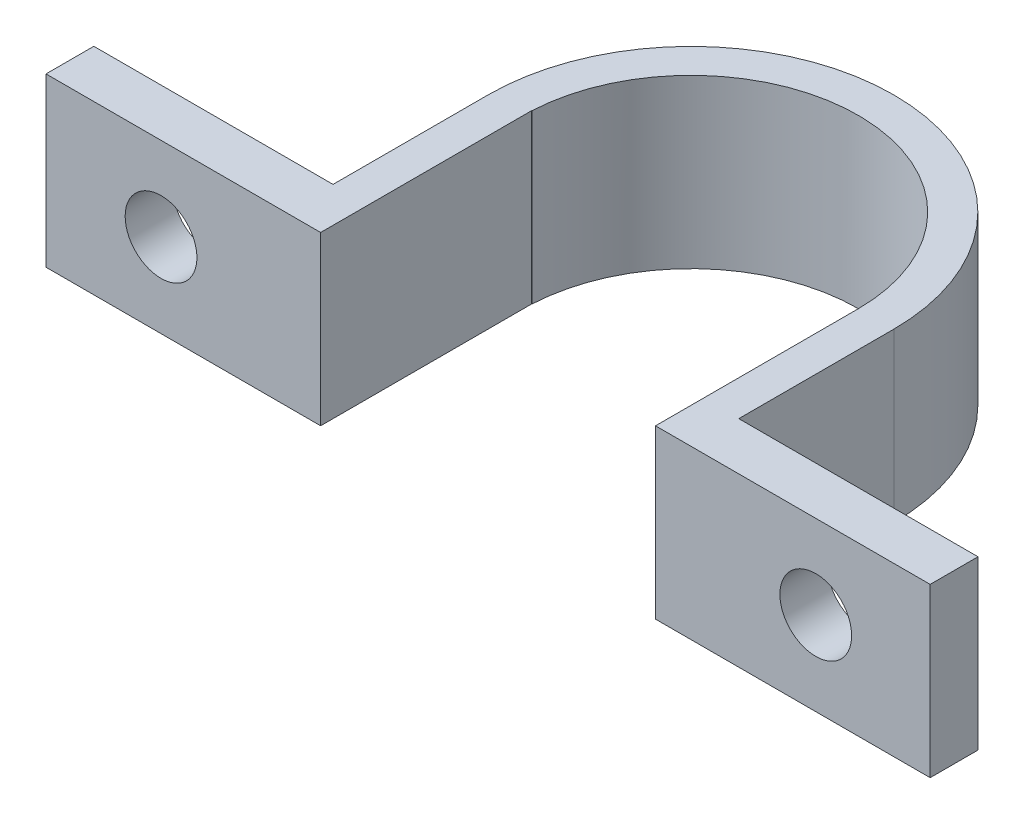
ISO-10303-21;
HEADER;
FILE_DESCRIPTION(('STEP AP214'),'2;1');
FILE_NAME('part.step','',(''),(''),'','','');
FILE_SCHEMA(('AUTOMOTIVE_DESIGN { 1 0 10303 214 1 1 1 1 }'));
ENDSEC;
DATA;
#1=APPLICATION_CONTEXT('core data for automotive mechanical design processes');
#2=APPLICATION_PROTOCOL_DEFINITION('international standard','automotive_design',2000,#1);
#3=PRODUCT_CONTEXT('',#1,'mechanical');
#4=PRODUCT('Part','Part','',(#3));
#5=PRODUCT_RELATED_PRODUCT_CATEGORY('part','',(#4));
#6=PRODUCT_DEFINITION_FORMATION('','',#4);
#7=PRODUCT_DEFINITION_CONTEXT('part definition',#1,'design');
#8=PRODUCT_DEFINITION('design','',#6,#7);
#9=PRODUCT_DEFINITION_SHAPE('','',#8);
#10=(LENGTH_UNIT() NAMED_UNIT(*) SI_UNIT(.MILLI.,.METRE.));
#11=(NAMED_UNIT(*) PLANE_ANGLE_UNIT() SI_UNIT($,.RADIAN.));
#12=(NAMED_UNIT(*) SI_UNIT($,.STERADIAN.) SOLID_ANGLE_UNIT());
#13=UNCERTAINTY_MEASURE_WITH_UNIT(LENGTH_MEASURE(1.E-05),#10,'distance_accuracy_value','');
#14=(GEOMETRIC_REPRESENTATION_CONTEXT(3) GLOBAL_UNCERTAINTY_ASSIGNED_CONTEXT((#13)) GLOBAL_UNIT_ASSIGNED_CONTEXT((#10,
#11,#12)) REPRESENTATION_CONTEXT('',''));
#15=CARTESIAN_POINT('',(0.,0.,0.));
#16=DIRECTION('',(0.,0.,1.));
#17=DIRECTION('',(1.,0.,0.));
#18=AXIS2_PLACEMENT_3D('',#15,#16,#17);
#19=CARTESIAN_POINT('',(0.,4.,0.));
#20=DIRECTION('',(0.,1.,0.));
#21=DIRECTION('',(0.,0.,1.));
#22=AXIS2_PLACEMENT_3D('',#19,#20,#21);
#23=CYLINDRICAL_SURFACE('',#22,7.);
#24=DIRECTION('',(0.,1.,0.));
#25=VECTOR('',#24,1.);
#26=CARTESIAN_POINT('',(-6.99172907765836,-9.00000000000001,-0.34018304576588));
#27=LINE('',#26,#25);
#28=CARTESIAN_POINT('',(-6.99172907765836,7.,-0.34018304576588));
#29=VERTEX_POINT('',#28);
#30=CARTESIAN_POINT('',(-6.99172907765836,0.,-0.34018304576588));
#31=VERTEX_POINT('',#30);
#32=EDGE_CURVE('E299',#29,#31,#27,.F.);
#33=ORIENTED_EDGE('',*,*,#32,.T.);
#34=CARTESIAN_POINT('',(0.,0.,0.));
#35=DIRECTION('',(0.,1.,0.));
#36=DIRECTION('',(0.,0.,1.));
#37=AXIS2_PLACEMENT_3D('',#34,#35,#36);
#38=CIRCLE('',#37,7.);
#39=CARTESIAN_POINT('',(6.99172907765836,0.,0.340183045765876));
#40=VERTEX_POINT('',#39);
#41=EDGE_CURVE('E191',#40,#31,#38,.T.);
#42=ORIENTED_EDGE('',*,*,#41,.F.);
#43=DIRECTION('',(0.,1.,0.));
#44=VECTOR('',#43,1.);
#45=CARTESIAN_POINT('',(6.99172907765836,-9.00000000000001,0.340183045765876));
#46=LINE('',#45,#44);
#47=CARTESIAN_POINT('',(6.99172907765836,4.,0.340183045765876));
#48=VERTEX_POINT('',#47);
#49=EDGE_CURVE('E189',#48,#40,#46,.F.);
#50=ORIENTED_EDGE('',*,*,#49,.F.);
#51=CARTESIAN_POINT('',(0.,4.,0.));
#52=DIRECTION('',(0.,1.,0.));
#53=DIRECTION('',(0.,0.,1.));
#54=AXIS2_PLACEMENT_3D('',#51,#52,#53);
#55=CIRCLE('',#54,7.);
#56=CARTESIAN_POINT('',(7.,4.,0.));
#57=VERTEX_POINT('',#56);
#58=EDGE_CURVE('E195',#48,#57,#55,.T.);
#59=ORIENTED_EDGE('',*,*,#58,.T.);
#60=DIRECTION('',(0.,1.,0.));
#61=VECTOR('',#60,1.);
#62=CARTESIAN_POINT('',(7.,4.,0.));
#63=LINE('',#62,#61);
#64=CARTESIAN_POINT('',(7.,7.,0.));
#65=VERTEX_POINT('',#64);
#66=EDGE_CURVE('E204',#57,#65,#63,.T.);
#67=ORIENTED_EDGE('',*,*,#66,.T.);
#68=CARTESIAN_POINT('',(0.,7.,0.));
#69=DIRECTION('',(0.,1.,0.));
#70=DIRECTION('',(0.,0.,1.));
#71=AXIS2_PLACEMENT_3D('',#68,#69,#70);
#72=CIRCLE('',#71,7.);
#73=EDGE_CURVE('E211',#65,#29,#72,.T.);
#74=ORIENTED_EDGE('',*,*,#73,.T.);
#75=EDGE_LOOP('',(#33,#42,#50,#59,#67,#74));
#76=FACE_BOUND('',#75,.T.);
#77=ADVANCED_FACE('F58',(#76),#23,.F.);
#78=CARTESIAN_POINT('',(0.,7.,0.));
#79=DIRECTION('',(0.,1.,0.));
#80=DIRECTION('',(0.,0.,1.));
#81=AXIS2_PLACEMENT_3D('',#78,#79,#80);
#82=PLANE('',#81);
#83=DIRECTION('',(-1.,0.,0.));
#84=VECTOR('',#83,1.);
#85=CARTESIAN_POINT('',(-7.,7.,8.48148798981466));
#86=LINE('',#85,#84);
#87=CARTESIAN_POINT('',(-7.,7.,8.48148798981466));
#88=VERTEX_POINT('',#87);
#89=CARTESIAN_POINT('',(-18.4814879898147,7.,8.48148798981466));
#90=VERTEX_POINT('',#89);
#91=EDGE_CURVE('E259',#88,#90,#86,.T.);
#92=ORIENTED_EDGE('',*,*,#91,.F.);
#93=DIRECTION('',(0.,0.,1.));
#94=VECTOR('',#93,1.);
#95=CARTESIAN_POINT('',(-7.,7.,0.));
#96=LINE('',#95,#94);
#97=CARTESIAN_POINT('',(-7.,7.,-0.34018304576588));
#98=VERTEX_POINT('',#97);
#99=EDGE_CURVE('E201',#98,#88,#96,.T.);
#100=ORIENTED_EDGE('',*,*,#99,.F.);
#101=DIRECTION('',(1.,0.,0.));
#102=VECTOR('',#101,1.);
#103=CARTESIAN_POINT('',(-7.,7.,-0.34018304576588));
#104=LINE('',#103,#102);
#105=EDGE_CURVE('E280',#98,#29,#104,.T.);
#106=ORIENTED_EDGE('',*,*,#105,.T.);
#107=ORIENTED_EDGE('',*,*,#73,.F.);
#108=DIRECTION('',(0.,0.,-1.));
#109=VECTOR('',#108,1.);
#110=CARTESIAN_POINT('',(7.,7.,10.4814879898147));
#111=LINE('',#110,#109);
#112=CARTESIAN_POINT('',(7.,7.,8.48148798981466));
#113=VERTEX_POINT('',#112);
#114=EDGE_CURVE('E205',#113,#65,#111,.T.);
#115=ORIENTED_EDGE('',*,*,#114,.F.);
#116=DIRECTION('',(-1.,0.,0.));
#117=VECTOR('',#116,1.);
#118=CARTESIAN_POINT('',(7.,7.,8.48148798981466));
#119=LINE('',#118,#117);
#120=CARTESIAN_POINT('',(18.4814879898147,7.,8.48148798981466));
#121=VERTEX_POINT('',#120);
#122=EDGE_CURVE('E75',#121,#113,#119,.T.);
#123=ORIENTED_EDGE('',*,*,#122,.F.);
#124=DIRECTION('',(0.,0.,1.));
#125=VECTOR('',#124,1.);
#126=CARTESIAN_POINT('',(18.4814879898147,7.,0.));
#127=LINE('',#126,#125);
#128=CARTESIAN_POINT('',(18.4814879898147,7.,6.48148798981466));
#129=VERTEX_POINT('',#128);
#130=EDGE_CURVE('E225',#129,#121,#127,.T.);
#131=ORIENTED_EDGE('',*,*,#130,.F.);
#132=DIRECTION('',(-1.,0.,0.));
#133=VECTOR('',#132,1.);
#134=CARTESIAN_POINT('',(8.48148798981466,7.,6.48148798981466));
#135=LINE('',#134,#133);
#136=CARTESIAN_POINT('',(8.48148798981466,7.,6.48148798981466));
#137=VERTEX_POINT('',#136);
#138=EDGE_CURVE('E276',#129,#137,#135,.T.);
#139=ORIENTED_EDGE('',*,*,#138,.T.);
#140=DIRECTION('',(0.,0.,1.));
#141=VECTOR('',#140,1.);
#142=CARTESIAN_POINT('',(8.48148798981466,7.,0.));
#143=LINE('',#142,#141);
#144=CARTESIAN_POINT('',(8.48148798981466,7.,0.));
#145=VERTEX_POINT('',#144);
#146=EDGE_CURVE('E228',#145,#137,#143,.T.);
#147=ORIENTED_EDGE('',*,*,#146,.F.);
#148=CARTESIAN_POINT('',(0.,7.,0.));
#149=DIRECTION('',(0.,1.,0.));
#150=DIRECTION('',(0.,0.,1.));
#151=AXIS2_PLACEMENT_3D('',#148,#149,#150);
#152=CIRCLE('',#151,8.48148798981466);
#153=CARTESIAN_POINT('',(-8.48148798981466,7.,0.));
#154=VERTEX_POINT('',#153);
#155=EDGE_CURVE('E215',#154,#145,#152,.F.);
#156=ORIENTED_EDGE('',*,*,#155,.F.);
#157=DIRECTION('',(0.,0.,1.));
#158=VECTOR('',#157,1.);
#159=CARTESIAN_POINT('',(-8.48148798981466,7.,0.));
#160=LINE('',#159,#158);
#161=CARTESIAN_POINT('',(-8.48148798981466,7.,6.48148798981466));
#162=VERTEX_POINT('',#161);
#163=EDGE_CURVE('E218',#154,#162,#160,.T.);
#164=ORIENTED_EDGE('',*,*,#163,.T.);
#165=DIRECTION('',(-1.,0.,0.));
#166=VECTOR('',#165,1.);
#167=CARTESIAN_POINT('',(-18.4814879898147,7.,6.48148798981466));
#168=LINE('',#167,#166);
#169=CARTESIAN_POINT('',(-18.4814879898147,7.,6.48148798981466));
#170=VERTEX_POINT('',#169);
#171=EDGE_CURVE('E273',#162,#170,#168,.T.);
#172=ORIENTED_EDGE('',*,*,#171,.T.);
#173=DIRECTION('',(0.,0.,1.));
#174=VECTOR('',#173,1.);
#175=CARTESIAN_POINT('',(-18.4814879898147,7.,0.));
#176=LINE('',#175,#174);
#177=EDGE_CURVE('E222',#170,#90,#176,.T.);
#178=ORIENTED_EDGE('',*,*,#177,.T.);
#179=EDGE_LOOP('',(#92,#100,#106,#107,#115,#123,#131,#139,#147,#156,#164,#172,#178));
#180=FACE_BOUND('',#179,.T.);
#181=ADVANCED_FACE('F312',(#180),#82,.T.);
#182=CARTESIAN_POINT('',(0.,0.,0.));
#183=DIRECTION('',(0.,1.,0.));
#184=DIRECTION('',(0.,0.,1.));
#185=AXIS2_PLACEMENT_3D('',#182,#183,#184);
#186=PLANE('',#185);
#187=DIRECTION('',(-1.,0.,0.));
#188=VECTOR('',#187,1.);
#189=CARTESIAN_POINT('',(0.,0.,8.48148798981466));
#190=LINE('',#189,#188);
#191=CARTESIAN_POINT('',(18.4814879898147,0.,8.48148798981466));
#192=VERTEX_POINT('',#191);
#193=CARTESIAN_POINT('',(6.99172907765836,0.,8.48148798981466));
#194=VERTEX_POINT('',#193);
#195=EDGE_CURVE('E166',#192,#194,#190,.T.);
#196=ORIENTED_EDGE('',*,*,#195,.T.);
#197=DIRECTION('',(0.,0.,-1.));
#198=VECTOR('',#197,1.);
#199=CARTESIAN_POINT('',(6.99172907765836,0.,0.));
#200=LINE('',#199,#198);
#201=EDGE_CURVE('E171',#194,#40,#200,.T.);
#202=ORIENTED_EDGE('',*,*,#201,.T.);
#203=ORIENTED_EDGE('',*,*,#41,.T.);
#204=DIRECTION('',(1.,0.,0.));
#205=VECTOR('',#204,1.);
#206=CARTESIAN_POINT('',(0.,0.,-0.34018304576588));
#207=LINE('',#206,#205);
#208=CARTESIAN_POINT('',(-7.,0.,-0.34018304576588));
#209=VERTEX_POINT('',#208);
#210=EDGE_CURVE('E193',#209,#31,#207,.T.);
#211=ORIENTED_EDGE('',*,*,#210,.F.);
#212=DIRECTION('',(0.,0.,-1.));
#213=VECTOR('',#212,1.);
#214=CARTESIAN_POINT('',(-7.,0.,0.));
#215=LINE('',#214,#213);
#216=CARTESIAN_POINT('',(-7.,0.,8.48148798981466));
#217=VERTEX_POINT('',#216);
#218=EDGE_CURVE('E190',#217,#209,#215,.T.);
#219=ORIENTED_EDGE('',*,*,#218,.F.);
#220=DIRECTION('',(-1.,0.,0.));
#221=VECTOR('',#220,1.);
#222=CARTESIAN_POINT('',(0.,0.,8.48148798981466));
#223=LINE('',#222,#221);
#224=CARTESIAN_POINT('',(-18.4814879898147,0.,8.48148798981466));
#225=VERTEX_POINT('',#224);
#226=EDGE_CURVE('E83',#217,#225,#223,.T.);
#227=ORIENTED_EDGE('',*,*,#226,.T.);
#228=DIRECTION('',(0.,0.,1.));
#229=VECTOR('',#228,1.);
#230=CARTESIAN_POINT('',(-18.4814879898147,0.,0.));
#231=LINE('',#230,#229);
#232=CARTESIAN_POINT('',(-18.4814879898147,0.,6.48148798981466));
#233=VERTEX_POINT('',#232);
#234=EDGE_CURVE('E236',#233,#225,#231,.T.);
#235=ORIENTED_EDGE('',*,*,#234,.F.);
#236=DIRECTION('',(-1.,0.,0.));
#237=VECTOR('',#236,1.);
#238=CARTESIAN_POINT('',(-18.4814879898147,0.,6.48148798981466));
#239=LINE('',#238,#237);
#240=CARTESIAN_POINT('',(-8.48148798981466,0.,6.48148798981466));
#241=VERTEX_POINT('',#240);
#242=EDGE_CURVE('E269',#241,#233,#239,.T.);
#243=ORIENTED_EDGE('',*,*,#242,.F.);
#244=DIRECTION('',(0.,0.,1.));
#245=VECTOR('',#244,1.);
#246=CARTESIAN_POINT('',(-8.48148798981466,0.,0.));
#247=LINE('',#246,#245);
#248=CARTESIAN_POINT('',(-8.48148798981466,0.,0.));
#249=VERTEX_POINT('',#248);
#250=EDGE_CURVE('E233',#249,#241,#247,.T.);
#251=ORIENTED_EDGE('',*,*,#250,.F.);
#252=CARTESIAN_POINT('',(0.,0.,0.));
#253=DIRECTION('',(0.,1.,0.));
#254=DIRECTION('',(0.,0.,1.));
#255=AXIS2_PLACEMENT_3D('',#252,#253,#254);
#256=CIRCLE('',#255,8.48148798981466);
#257=CARTESIAN_POINT('',(8.48148798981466,0.,0.));
#258=VERTEX_POINT('',#257);
#259=EDGE_CURVE('E214',#249,#258,#256,.F.);
#260=ORIENTED_EDGE('',*,*,#259,.T.);
#261=DIRECTION('',(0.,0.,1.));
#262=VECTOR('',#261,1.);
#263=CARTESIAN_POINT('',(8.48148798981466,0.,0.));
#264=LINE('',#263,#262);
#265=CARTESIAN_POINT('',(8.48148798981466,0.,6.48148798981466));
#266=VERTEX_POINT('',#265);
#267=EDGE_CURVE('E219',#258,#266,#264,.T.);
#268=ORIENTED_EDGE('',*,*,#267,.T.);
#269=DIRECTION('',(-1.,0.,0.));
#270=VECTOR('',#269,1.);
#271=CARTESIAN_POINT('',(8.48148798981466,0.,6.48148798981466));
#272=LINE('',#271,#270);
#273=CARTESIAN_POINT('',(18.4814879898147,0.,6.48148798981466));
#274=VERTEX_POINT('',#273);
#275=EDGE_CURVE('E286',#274,#266,#272,.T.);
#276=ORIENTED_EDGE('',*,*,#275,.F.);
#277=DIRECTION('',(0.,0.,1.));
#278=VECTOR('',#277,1.);
#279=CARTESIAN_POINT('',(18.4814879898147,0.,0.));
#280=LINE('',#279,#278);
#281=EDGE_CURVE('E174',#274,#192,#280,.T.);
#282=ORIENTED_EDGE('',*,*,#281,.T.);
#283=EDGE_LOOP('',(#196,#202,#203,#211,#219,#227,#235,#243,#251,#260,#268,#276,#282));
#284=FACE_BOUND('',#283,.T.);
#285=ADVANCED_FACE('F168',(#284),#186,.F.);
#286=CARTESIAN_POINT('',(0.,7.,0.));
#287=DIRECTION('',(0.,-1.,0.));
#288=DIRECTION('',(0.,0.,-1.));
#289=AXIS2_PLACEMENT_3D('',#286,#287,#288);
#290=CYLINDRICAL_SURFACE('',#289,8.48148798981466);
#291=ORIENTED_EDGE('',*,*,#259,.F.);
#292=DIRECTION('',(0.,-1.,0.));
#293=VECTOR('',#292,1.);
#294=CARTESIAN_POINT('',(-8.48148798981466,7.,0.));
#295=LINE('',#294,#293);
#296=EDGE_CURVE('E67',#154,#249,#295,.T.);
#297=ORIENTED_EDGE('',*,*,#296,.F.);
#298=ORIENTED_EDGE('',*,*,#155,.T.);
#299=DIRECTION('',(0.,-1.,0.));
#300=VECTOR('',#299,1.);
#301=CARTESIAN_POINT('',(8.48148798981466,7.,0.));
#302=LINE('',#301,#300);
#303=EDGE_CURVE('E230',#145,#258,#302,.T.);
#304=ORIENTED_EDGE('',*,*,#303,.T.);
#305=EDGE_LOOP('',(#291,#297,#298,#304));
#306=FACE_BOUND('',#305,.T.);
#307=ADVANCED_FACE('F60',(#306),#290,.T.);
#308=CARTESIAN_POINT('',(-8.48148798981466,7.,0.));
#309=DIRECTION('',(1.,0.,0.));
#310=DIRECTION('',(0.,0.,-1.));
#311=AXIS2_PLACEMENT_3D('',#308,#309,#310);
#312=PLANE('',#311);
#313=ORIENTED_EDGE('',*,*,#250,.T.);
#314=DIRECTION('',(0.,1.,0.));
#315=VECTOR('',#314,1.);
#316=CARTESIAN_POINT('',(-8.48148798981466,0.,6.48148798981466));
#317=LINE('',#316,#315);
#318=EDGE_CURVE('E272',#241,#162,#317,.T.);
#319=ORIENTED_EDGE('',*,*,#318,.T.);
#320=ORIENTED_EDGE('',*,*,#163,.F.);
#321=ORIENTED_EDGE('',*,*,#296,.T.);
#322=EDGE_LOOP('',(#313,#319,#320,#321));
#323=FACE_BOUND('',#322,.T.);
#324=ADVANCED_FACE('F330',(#323),#312,.F.);
#325=CARTESIAN_POINT('',(-18.4814879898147,7.,0.));
#326=DIRECTION('',(1.,0.,0.));
#327=DIRECTION('',(0.,0.,-1.));
#328=AXIS2_PLACEMENT_3D('',#325,#326,#327);
#329=PLANE('',#328);
#330=ORIENTED_EDGE('',*,*,#234,.T.);
#331=DIRECTION('',(0.,1.,0.));
#332=VECTOR('',#331,1.);
#333=CARTESIAN_POINT('',(-18.4814879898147,-3.,8.48148798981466));
#334=LINE('',#333,#332);
#335=EDGE_CURVE('E251',#225,#90,#334,.T.);
#336=ORIENTED_EDGE('',*,*,#335,.T.);
#337=ORIENTED_EDGE('',*,*,#177,.F.);
#338=DIRECTION('',(0.,1.,0.));
#339=VECTOR('',#338,1.);
#340=CARTESIAN_POINT('',(-18.4814879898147,0.,6.48148798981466));
#341=LINE('',#340,#339);
#342=EDGE_CURVE('E277',#233,#170,#341,.T.);
#343=ORIENTED_EDGE('',*,*,#342,.F.);
#344=EDGE_LOOP('',(#330,#336,#337,#343));
#345=FACE_BOUND('',#344,.T.);
#346=ADVANCED_FACE('F323',(#345),#329,.F.);
#347=CARTESIAN_POINT('',(18.4814879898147,7.,0.));
#348=DIRECTION('',(1.,0.,0.));
#349=DIRECTION('',(0.,0.,-1.));
#350=AXIS2_PLACEMENT_3D('',#347,#348,#349);
#351=PLANE('',#350);
#352=DIRECTION('',(0.,1.,0.));
#353=VECTOR('',#352,1.);
#354=CARTESIAN_POINT('',(18.4814879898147,-3.,8.48148798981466));
#355=LINE('',#354,#353);
#356=EDGE_CURVE('E264',#192,#121,#355,.T.);
#357=ORIENTED_EDGE('',*,*,#356,.F.);
#358=ORIENTED_EDGE('',*,*,#281,.F.);
#359=DIRECTION('',(0.,1.,0.));
#360=VECTOR('',#359,1.);
#361=CARTESIAN_POINT('',(18.4814879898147,0.,6.48148798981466));
#362=LINE('',#361,#360);
#363=EDGE_CURVE('E283',#274,#129,#362,.T.);
#364=ORIENTED_EDGE('',*,*,#363,.T.);
#365=ORIENTED_EDGE('',*,*,#130,.T.);
#366=EDGE_LOOP('',(#357,#358,#364,#365));
#367=FACE_BOUND('',#366,.T.);
#368=ADVANCED_FACE('F343',(#367),#351,.T.);
#369=CARTESIAN_POINT('',(8.48148798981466,7.,0.));
#370=DIRECTION('',(1.,0.,0.));
#371=DIRECTION('',(0.,0.,-1.));
#372=AXIS2_PLACEMENT_3D('',#369,#370,#371);
#373=PLANE('',#372);
#374=DIRECTION('',(0.,1.,0.));
#375=VECTOR('',#374,1.);
#376=CARTESIAN_POINT('',(8.48148798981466,0.,6.48148798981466));
#377=LINE('',#376,#375);
#378=EDGE_CURVE('E248',#266,#137,#377,.T.);
#379=ORIENTED_EDGE('',*,*,#378,.F.);
#380=ORIENTED_EDGE('',*,*,#267,.F.);
#381=ORIENTED_EDGE('',*,*,#303,.F.);
#382=ORIENTED_EDGE('',*,*,#146,.T.);
#383=EDGE_LOOP('',(#379,#380,#381,#382));
#384=FACE_BOUND('',#383,.T.);
#385=ADVANCED_FACE('F337',(#384),#373,.T.);
#386=CARTESIAN_POINT('',(0.,4.,0.));
#387=DIRECTION('',(0.,1.,0.));
#388=DIRECTION('',(0.,0.,1.));
#389=AXIS2_PLACEMENT_3D('',#386,#387,#388);
#390=PLANE('',#389);
#391=DIRECTION('',(-1.,0.,0.));
#392=VECTOR('',#391,1.);
#393=CARTESIAN_POINT('',(0.,4.,8.48148798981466));
#394=LINE('',#393,#392);
#395=CARTESIAN_POINT('',(7.,4.,8.48148798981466));
#396=VERTEX_POINT('',#395);
#397=CARTESIAN_POINT('',(6.99172907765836,4.,8.48148798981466));
#398=VERTEX_POINT('',#397);
#399=EDGE_CURVE('E182',#396,#398,#394,.T.);
#400=ORIENTED_EDGE('',*,*,#399,.F.);
#401=DIRECTION('',(0.,0.,-1.));
#402=VECTOR('',#401,1.);
#403=CARTESIAN_POINT('',(7.,4.,10.4814879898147));
#404=LINE('',#403,#402);
#405=EDGE_CURVE('E202',#396,#57,#404,.T.);
#406=ORIENTED_EDGE('',*,*,#405,.T.);
#407=ORIENTED_EDGE('',*,*,#58,.F.);
#408=DIRECTION('',(0.,0.,-1.));
#409=VECTOR('',#408,1.);
#410=CARTESIAN_POINT('',(6.99172907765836,4.,0.));
#411=LINE('',#410,#409);
#412=EDGE_CURVE('E12',#398,#48,#411,.T.);
#413=ORIENTED_EDGE('',*,*,#412,.F.);
#414=EDGE_LOOP('',(#400,#406,#407,#413));
#415=FACE_BOUND('',#414,.T.);
#416=ADVANCED_FACE('F351',(#415),#390,.T.);
#417=CARTESIAN_POINT('',(7.,4.,10.4814879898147));
#418=DIRECTION('',(1.,0.,0.));
#419=DIRECTION('',(0.,0.,-1.));
#420=AXIS2_PLACEMENT_3D('',#417,#418,#419);
#421=PLANE('',#420);
#422=ORIENTED_EDGE('',*,*,#405,.F.);
#423=DIRECTION('',(0.,1.,0.));
#424=VECTOR('',#423,1.);
#425=CARTESIAN_POINT('',(7.,-3.,8.48148798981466));
#426=LINE('',#425,#424);
#427=EDGE_CURVE('E266',#396,#113,#426,.T.);
#428=ORIENTED_EDGE('',*,*,#427,.T.);
#429=ORIENTED_EDGE('',*,*,#114,.T.);
#430=ORIENTED_EDGE('',*,*,#66,.F.);
#431=EDGE_LOOP('',(#422,#428,#429,#430));
#432=FACE_BOUND('',#431,.T.);
#433=ADVANCED_FACE('F308',(#432),#421,.F.);
#434=CARTESIAN_POINT('',(-7.,4.,0.));
#435=DIRECTION('',(-1.,0.,0.));
#436=DIRECTION('',(0.,0.,1.));
#437=AXIS2_PLACEMENT_3D('',#434,#435,#436);
#438=PLANE('',#437);
#439=ORIENTED_EDGE('',*,*,#99,.T.);
#440=DIRECTION('',(0.,1.,0.));
#441=VECTOR('',#440,1.);
#442=CARTESIAN_POINT('',(-7.,-3.,8.48148798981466));
#443=LINE('',#442,#441);
#444=EDGE_CURVE('E256',#217,#88,#443,.T.);
#445=ORIENTED_EDGE('',*,*,#444,.F.);
#446=ORIENTED_EDGE('',*,*,#218,.T.);
#447=DIRECTION('',(0.,1.,0.));
#448=VECTOR('',#447,1.);
#449=CARTESIAN_POINT('',(-7.,-9.00000000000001,-0.34018304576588));
#450=LINE('',#449,#448);
#451=EDGE_CURVE('E295',#209,#98,#450,.T.);
#452=ORIENTED_EDGE('',*,*,#451,.T.);
#453=EDGE_LOOP('',(#439,#445,#446,#452));
#454=FACE_BOUND('',#453,.T.);
#455=ADVANCED_FACE('F320',(#454),#438,.F.);
#456=CARTESIAN_POINT('',(-7.,-9.00000000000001,-0.34018304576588));
#457=DIRECTION('',(0.,0.,1.));
#458=DIRECTION('',(1.,0.,0.));
#459=AXIS2_PLACEMENT_3D('',#456,#457,#458);
#460=PLANE('',#459);
#461=ORIENTED_EDGE('',*,*,#210,.T.);
#462=ORIENTED_EDGE('',*,*,#32,.F.);
#463=ORIENTED_EDGE('',*,*,#105,.F.);
#464=ORIENTED_EDGE('',*,*,#451,.F.);
#465=EDGE_LOOP('',(#461,#462,#463,#464));
#466=FACE_BOUND('',#465,.T.);
#467=ADVANCED_FACE('F317',(#466),#460,.T.);
#468=CARTESIAN_POINT('',(6.99172907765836,-9.00000000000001,10.4814879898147));
#469=DIRECTION('',(1.,0.,0.));
#470=DIRECTION('',(0.,0.,-1.));
#471=AXIS2_PLACEMENT_3D('',#468,#469,#470);
#472=PLANE('',#471);
#473=ORIENTED_EDGE('',*,*,#201,.F.);
#474=DIRECTION('',(0.,1.,0.));
#475=VECTOR('',#474,1.);
#476=CARTESIAN_POINT('',(6.99172907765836,-9.00000000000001,8.48148798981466));
#477=LINE('',#476,#475);
#478=EDGE_CURVE('E179',#194,#398,#477,.T.);
#479=ORIENTED_EDGE('',*,*,#478,.T.);
#480=ORIENTED_EDGE('',*,*,#412,.T.);
#481=ORIENTED_EDGE('',*,*,#49,.T.);
#482=EDGE_LOOP('',(#473,#479,#480,#481));
#483=FACE_BOUND('',#482,.T.);
#484=ADVANCED_FACE('F187',(#483),#472,.F.);
#485=CARTESIAN_POINT('',(13.6993545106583,3.5,24.4814879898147));
#486=DIRECTION('',(0.,0.,-1.));
#487=DIRECTION('',(-1.,0.,0.));
#488=AXIS2_PLACEMENT_3D('',#485,#486,#487);
#489=CYLINDRICAL_SURFACE('',#488,1.5);
#490=CARTESIAN_POINT('',(13.6993545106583,3.5,8.48148798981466));
#491=DIRECTION('',(0.,0.,-1.));
#492=DIRECTION('',(-1.,0.,0.));
#493=AXIS2_PLACEMENT_3D('',#490,#491,#492);
#494=CIRCLE('',#493,1.5);
#495=CARTESIAN_POINT('',(12.1993545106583,3.5,8.48148798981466));
#496=VERTEX_POINT('',#495);
#497=EDGE_CURVE('E62',#496,#496,#494,.F.);
#498=ORIENTED_EDGE('',*,*,#497,.T.);
#499=EDGE_LOOP('',(#498));
#500=FACE_BOUND('',#499,.T.);
#501=CARTESIAN_POINT('',(13.6993545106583,3.5,6.48148798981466));
#502=DIRECTION('',(0.,0.,-1.));
#503=DIRECTION('',(-1.,0.,0.));
#504=AXIS2_PLACEMENT_3D('',#501,#502,#503);
#505=CIRCLE('',#504,1.5);
#506=CARTESIAN_POINT('',(12.1993545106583,3.5,6.48148798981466));
#507=VERTEX_POINT('',#506);
#508=EDGE_CURVE('E246',#507,#507,#505,.T.);
#509=ORIENTED_EDGE('',*,*,#508,.T.);
#510=EDGE_LOOP('',(#509));
#511=FACE_BOUND('',#510,.T.);
#512=ADVANCED_FACE('F473',(#500,#511),#489,.F.);
#513=CARTESIAN_POINT('',(-13.6725455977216,3.5,24.4814879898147));
#514=DIRECTION('',(0.,0.,-1.));
#515=DIRECTION('',(-1.,0.,0.));
#516=AXIS2_PLACEMENT_3D('',#513,#514,#515);
#517=CYLINDRICAL_SURFACE('',#516,1.5);
#518=CARTESIAN_POINT('',(-13.6725455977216,3.5,8.48148798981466));
#519=DIRECTION('',(0.,0.,-1.));
#520=DIRECTION('',(-1.,0.,0.));
#521=AXIS2_PLACEMENT_3D('',#518,#519,#520);
#522=CIRCLE('',#521,1.5);
#523=CARTESIAN_POINT('',(-15.1725455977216,3.5,8.48148798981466));
#524=VERTEX_POINT('',#523);
#525=EDGE_CURVE('E249',#524,#524,#522,.F.);
#526=ORIENTED_EDGE('',*,*,#525,.T.);
#527=EDGE_LOOP('',(#526));
#528=FACE_BOUND('',#527,.T.);
#529=CARTESIAN_POINT('',(-13.6725455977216,3.5,6.48148798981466));
#530=DIRECTION('',(0.,0.,-1.));
#531=DIRECTION('',(-1.,0.,0.));
#532=AXIS2_PLACEMENT_3D('',#529,#530,#531);
#533=CIRCLE('',#532,1.5);
#534=CARTESIAN_POINT('',(-15.1725455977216,3.5,6.48148798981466));
#535=VERTEX_POINT('',#534);
#536=EDGE_CURVE('E176',#535,#535,#533,.T.);
#537=ORIENTED_EDGE('',*,*,#536,.T.);
#538=EDGE_LOOP('',(#537));
#539=FACE_BOUND('',#538,.T.);
#540=ADVANCED_FACE('F391',(#528,#539),#517,.F.);
#541=CARTESIAN_POINT('',(8.48148798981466,0.,6.48148798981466));
#542=DIRECTION('',(0.,0.,-1.));
#543=DIRECTION('',(-1.,0.,0.));
#544=AXIS2_PLACEMENT_3D('',#541,#542,#543);
#545=PLANE('',#544);
#546=ORIENTED_EDGE('',*,*,#508,.F.);
#547=EDGE_LOOP('',(#546));
#548=FACE_BOUND('',#547,.T.);
#549=ORIENTED_EDGE('',*,*,#138,.F.);
#550=ORIENTED_EDGE('',*,*,#363,.F.);
#551=ORIENTED_EDGE('',*,*,#275,.T.);
#552=ORIENTED_EDGE('',*,*,#378,.T.);
#553=EDGE_LOOP('',(#549,#550,#551,#552));
#554=FACE_BOUND('',#553,.T.);
#555=ADVANCED_FACE('F340',(#548,#554),#545,.T.);
#556=CARTESIAN_POINT('',(-18.4814879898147,0.,6.48148798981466));
#557=DIRECTION('',(0.,0.,-1.));
#558=DIRECTION('',(-1.,0.,0.));
#559=AXIS2_PLACEMENT_3D('',#556,#557,#558);
#560=PLANE('',#559);
#561=ORIENTED_EDGE('',*,*,#536,.F.);
#562=EDGE_LOOP('',(#561));
#563=FACE_BOUND('',#562,.T.);
#564=ORIENTED_EDGE('',*,*,#171,.F.);
#565=ORIENTED_EDGE('',*,*,#318,.F.);
#566=ORIENTED_EDGE('',*,*,#242,.T.);
#567=ORIENTED_EDGE('',*,*,#342,.T.);
#568=EDGE_LOOP('',(#564,#565,#566,#567));
#569=FACE_BOUND('',#568,.T.);
#570=ADVANCED_FACE('F325',(#563,#569),#560,.T.);
#571=CARTESIAN_POINT('',(-7.,-3.,8.48148798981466));
#572=DIRECTION('',(0.,0.,-1.));
#573=DIRECTION('',(-1.,0.,0.));
#574=AXIS2_PLACEMENT_3D('',#571,#572,#573);
#575=PLANE('',#574);
#576=ORIENTED_EDGE('',*,*,#525,.F.);
#577=EDGE_LOOP('',(#576));
#578=FACE_BOUND('',#577,.T.);
#579=ORIENTED_EDGE('',*,*,#444,.T.);
#580=ORIENTED_EDGE('',*,*,#91,.T.);
#581=ORIENTED_EDGE('',*,*,#335,.F.);
#582=ORIENTED_EDGE('',*,*,#226,.F.);
#583=EDGE_LOOP('',(#579,#580,#581,#582));
#584=FACE_BOUND('',#583,.T.);
#585=ADVANCED_FACE('F321',(#578,#584),#575,.F.);
#586=CARTESIAN_POINT('',(7.,-3.,8.48148798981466));
#587=DIRECTION('',(0.,0.,-1.));
#588=DIRECTION('',(-1.,0.,0.));
#589=AXIS2_PLACEMENT_3D('',#586,#587,#588);
#590=PLANE('',#589);
#591=ORIENTED_EDGE('',*,*,#478,.F.);
#592=ORIENTED_EDGE('',*,*,#195,.F.);
#593=ORIENTED_EDGE('',*,*,#356,.T.);
#594=ORIENTED_EDGE('',*,*,#122,.T.);
#595=ORIENTED_EDGE('',*,*,#427,.F.);
#596=ORIENTED_EDGE('',*,*,#399,.T.);
#597=EDGE_LOOP('',(#591,#592,#593,#594,#595,#596));
#598=FACE_BOUND('',#597,.T.);
#599=ORIENTED_EDGE('',*,*,#497,.F.);
#600=EDGE_LOOP('',(#599));
#601=FACE_BOUND('',#600,.T.);
#602=ADVANCED_FACE('F180',(#598,#601),#590,.F.);
#603=CLOSED_SHELL('',(#77,#181,#285,#307,#324,#346,#368,#385,#416,#433,#455,#467,#484,#512,#540,
#555,#570,#585,#602));
#604=MANIFOLD_SOLID_BREP('B2',#603);
#605=ADVANCED_BREP_SHAPE_REPRESENTATION('',(#18,#604),#14);
#606=SHAPE_DEFINITION_REPRESENTATION(#9,#605);
ENDSEC;
END-ISO-10303-21;
